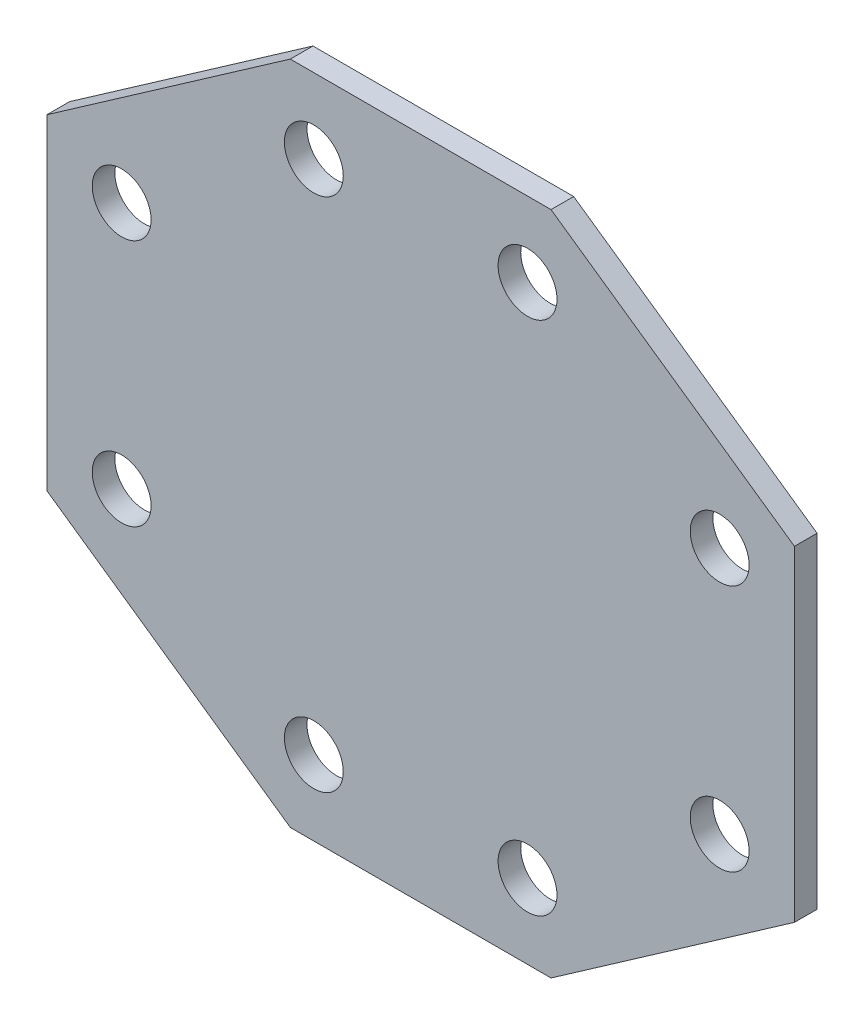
from build123d import *

# Parameters (mm, degrees)
MAIN_PLATE_DEPTH        = 31.75
CUT_EXTRUDE1_DEPTH      = 703.061769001
CUT_EXTRUDE1_DEPTH_BACK = 703.061769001
SKETCH5_R               = 41.275


with BuildPart() as part:
    # Sketch3 → Main Plate (new body)
    with BuildSketch(Plane(origin=(0, 0, 0), x_dir=(0, 1, 0), z_dir=(0, 0, 1))):
        Polygon((228.234235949, 523.855268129), (466.324268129, 182.70492307), (466.324268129, -182.70492307), (228.234235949, -523.855268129), (-228.234235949, -523.855268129), (-466.324268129, -182.70492307), (-466.324268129, 182.70492307), (-228.234235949, 523.855268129), align=None)
    extrude(amount=MAIN_PLATE_DEPTH)

    # Sketch5 → Cut-Extrude1 (cut, two sides: drawn at the far end of the back side and taken through both)
    with BuildSketch(Plane(origin=(0, 0, 0), x_dir=(0, 1, 0), z_dir=(0, 0, 1)).offset(-CUT_EXTRUDE1_DEPTH_BACK)):
        with Locations(Location((-173.588730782, 419.080268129, 0), (0, 0, 270))):
            Circle(SKETCH5_R)
        with Locations(Location((173.588730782, 419.080268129, 0), (0, 0, 270))):
            Circle(SKETCH5_R)
        with Locations(Location((361.549268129, 149.758610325, 0), (0, 0, 270))):
            Circle(SKETCH5_R)
        with Locations(Location((361.549268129, -149.758610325, 0), (0, 0, 270))):
            Circle(SKETCH5_R)
        with Locations(Location((173.588730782, -419.080268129, 0), (0, 0, 270))):
            Circle(SKETCH5_R)
        with Locations(Location((-173.588730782, -419.080268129, 0), (0, 0, 270))):
            Circle(SKETCH5_R)
        with Locations(Location((-361.549268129, -149.758610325, 0), (0, 0, 270))):
            Circle(SKETCH5_R)
        with Locations(Location((-361.549268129, 149.758610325, 0), (0, 0, 270))):
            Circle(SKETCH5_R)
    extrude(amount=CUT_EXTRUDE1_DEPTH + CUT_EXTRUDE1_DEPTH_BACK, mode=Mode.SUBTRACT)


solid = part.part
